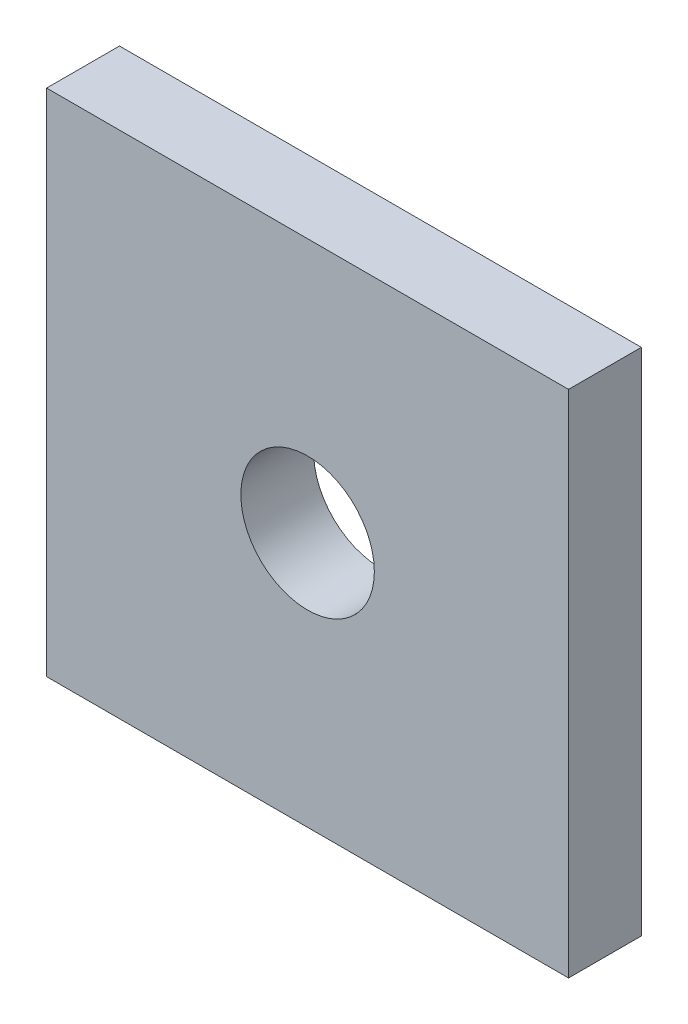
ISO-10303-21;
HEADER;
FILE_DESCRIPTION(('STEP AP214'),'2;1');
FILE_NAME('part.step','',(''),(''),'','','');
FILE_SCHEMA(('AUTOMOTIVE_DESIGN { 1 0 10303 214 1 1 1 1 }'));
ENDSEC;
DATA;
#1=APPLICATION_CONTEXT('core data for automotive mechanical design processes');
#2=APPLICATION_PROTOCOL_DEFINITION('international standard','automotive_design',2000,#1);
#3=PRODUCT_CONTEXT('',#1,'mechanical');
#4=PRODUCT('Part','Part','',(#3));
#5=PRODUCT_RELATED_PRODUCT_CATEGORY('part','',(#4));
#6=PRODUCT_DEFINITION_FORMATION('','',#4);
#7=PRODUCT_DEFINITION_CONTEXT('part definition',#1,'design');
#8=PRODUCT_DEFINITION('design','',#6,#7);
#9=PRODUCT_DEFINITION_SHAPE('','',#8);
#10=(LENGTH_UNIT() NAMED_UNIT(*) SI_UNIT(.MILLI.,.METRE.));
#11=(NAMED_UNIT(*) PLANE_ANGLE_UNIT() SI_UNIT($,.RADIAN.));
#12=(NAMED_UNIT(*) SI_UNIT($,.STERADIAN.) SOLID_ANGLE_UNIT());
#13=UNCERTAINTY_MEASURE_WITH_UNIT(LENGTH_MEASURE(1.E-05),#10,'distance_accuracy_value','');
#14=(GEOMETRIC_REPRESENTATION_CONTEXT(3) GLOBAL_UNCERTAINTY_ASSIGNED_CONTEXT((#13)) GLOBAL_UNIT_ASSIGNED_CONTEXT((#10,
#11,#12)) REPRESENTATION_CONTEXT('',''));
#15=CARTESIAN_POINT('',(0.,0.,0.));
#16=DIRECTION('',(0.,0.,1.));
#17=DIRECTION('',(1.,0.,0.));
#18=AXIS2_PLACEMENT_3D('',#15,#16,#17);
#19=CARTESIAN_POINT('',(0.,0.,6.));
#20=DIRECTION('',(0.,0.,1.));
#21=DIRECTION('',(1.,0.,0.));
#22=AXIS2_PLACEMENT_3D('',#19,#20,#21);
#23=PLANE('',#22);
#24=DIRECTION('',(0.,1.,0.));
#25=VECTOR('',#24,1.);
#26=CARTESIAN_POINT('',(21.5,21.,6.));
#27=LINE('',#26,#25);
#28=CARTESIAN_POINT('',(21.5,-21.,6.));
#29=VERTEX_POINT('',#28);
#30=CARTESIAN_POINT('',(21.5,21.,6.));
#31=VERTEX_POINT('',#30);
#32=EDGE_CURVE('E85',#29,#31,#27,.T.);
#33=ORIENTED_EDGE('',*,*,#32,.T.);
#34=DIRECTION('',(-1.,0.,0.));
#35=VECTOR('',#34,1.);
#36=CARTESIAN_POINT('',(-21.5,21.,6.));
#37=LINE('',#36,#35);
#38=CARTESIAN_POINT('',(-21.5,21.,6.));
#39=VERTEX_POINT('',#38);
#40=EDGE_CURVE('E80',#31,#39,#37,.T.);
#41=ORIENTED_EDGE('',*,*,#40,.T.);
#42=DIRECTION('',(0.,-1.,0.));
#43=VECTOR('',#42,1.);
#44=CARTESIAN_POINT('',(-21.5,21.,6.));
#45=LINE('',#44,#43);
#46=CARTESIAN_POINT('',(-21.5,-21.,6.));
#47=VERTEX_POINT('',#46);
#48=EDGE_CURVE('E83',#39,#47,#45,.T.);
#49=ORIENTED_EDGE('',*,*,#48,.T.);
#50=DIRECTION('',(1.,0.,0.));
#51=VECTOR('',#50,1.);
#52=CARTESIAN_POINT('',(-21.5,-21.,6.));
#53=LINE('',#52,#51);
#54=EDGE_CURVE('E50',#47,#29,#53,.T.);
#55=ORIENTED_EDGE('',*,*,#54,.T.);
#56=EDGE_LOOP('',(#33,#41,#49,#55));
#57=FACE_BOUND('',#56,.T.);
#58=CARTESIAN_POINT('',(0.,0.,6.));
#59=DIRECTION('',(0.,0.,1.));
#60=DIRECTION('',(1.,0.,0.));
#61=AXIS2_PLACEMENT_3D('',#58,#59,#60);
#62=CIRCLE('',#61,5.5);
#63=CARTESIAN_POINT('',(5.49999999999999,0.,6.));
#64=VERTEX_POINT('',#63);
#65=EDGE_CURVE('E100',#64,#64,#62,.T.);
#66=ORIENTED_EDGE('',*,*,#65,.F.);
#67=EDGE_LOOP('',(#66));
#68=FACE_BOUND('',#67,.T.);
#69=ADVANCED_FACE('F33',(#57,#68),#23,.T.);
#70=CARTESIAN_POINT('',(0.,0.,0.));
#71=DIRECTION('',(0.,0.,1.));
#72=DIRECTION('',(1.,0.,0.));
#73=AXIS2_PLACEMENT_3D('',#70,#71,#72);
#74=PLANE('',#73);
#75=DIRECTION('',(0.,1.,0.));
#76=VECTOR('',#75,1.);
#77=CARTESIAN_POINT('',(21.5,21.,0.));
#78=LINE('',#77,#76);
#79=CARTESIAN_POINT('',(21.5,-21.,0.));
#80=VERTEX_POINT('',#79);
#81=CARTESIAN_POINT('',(21.5,21.,0.));
#82=VERTEX_POINT('',#81);
#83=EDGE_CURVE('E97',#80,#82,#78,.T.);
#84=ORIENTED_EDGE('',*,*,#83,.F.);
#85=DIRECTION('',(1.,0.,0.));
#86=VECTOR('',#85,1.);
#87=CARTESIAN_POINT('',(-21.5,-21.,0.));
#88=LINE('',#87,#86);
#89=CARTESIAN_POINT('',(-21.5,-21.,0.));
#90=VERTEX_POINT('',#89);
#91=EDGE_CURVE('E73',#90,#80,#88,.T.);
#92=ORIENTED_EDGE('',*,*,#91,.F.);
#93=DIRECTION('',(0.,-1.,0.));
#94=VECTOR('',#93,1.);
#95=CARTESIAN_POINT('',(-21.5,21.,0.));
#96=LINE('',#95,#94);
#97=CARTESIAN_POINT('',(-21.5,21.,0.));
#98=VERTEX_POINT('',#97);
#99=EDGE_CURVE('E67',#98,#90,#96,.T.);
#100=ORIENTED_EDGE('',*,*,#99,.F.);
#101=DIRECTION('',(-1.,0.,0.));
#102=VECTOR('',#101,1.);
#103=CARTESIAN_POINT('',(-21.5,21.,0.));
#104=LINE('',#103,#102);
#105=EDGE_CURVE('E89',#82,#98,#104,.T.);
#106=ORIENTED_EDGE('',*,*,#105,.F.);
#107=EDGE_LOOP('',(#84,#92,#100,#106));
#108=FACE_BOUND('',#107,.T.);
#109=CARTESIAN_POINT('',(0.,0.,0.));
#110=DIRECTION('',(0.,0.,1.));
#111=DIRECTION('',(1.,0.,0.));
#112=AXIS2_PLACEMENT_3D('',#109,#110,#111);
#113=CIRCLE('',#112,5.5);
#114=CARTESIAN_POINT('',(5.49999999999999,0.,0.));
#115=VERTEX_POINT('',#114);
#116=EDGE_CURVE('E112',#115,#115,#113,.T.);
#117=ORIENTED_EDGE('',*,*,#116,.T.);
#118=EDGE_LOOP('',(#117));
#119=FACE_BOUND('',#118,.T.);
#120=ADVANCED_FACE('F108',(#108,#119),#74,.F.);
#121=CARTESIAN_POINT('',(21.5,21.,6.));
#122=DIRECTION('',(-1.,0.,0.));
#123=DIRECTION('',(0.,-1.,0.));
#124=AXIS2_PLACEMENT_3D('',#121,#122,#123);
#125=PLANE('',#124);
#126=ORIENTED_EDGE('',*,*,#83,.T.);
#127=DIRECTION('',(0.,0.,-1.));
#128=VECTOR('',#127,1.);
#129=CARTESIAN_POINT('',(21.5,21.,6.));
#130=LINE('',#129,#128);
#131=EDGE_CURVE('E11',#31,#82,#130,.T.);
#132=ORIENTED_EDGE('',*,*,#131,.F.);
#133=ORIENTED_EDGE('',*,*,#32,.F.);
#134=DIRECTION('',(0.,0.,-1.));
#135=VECTOR('',#134,1.);
#136=CARTESIAN_POINT('',(21.5,-21.,6.));
#137=LINE('',#136,#135);
#138=EDGE_CURVE('E93',#29,#80,#137,.T.);
#139=ORIENTED_EDGE('',*,*,#138,.T.);
#140=EDGE_LOOP('',(#126,#132,#133,#139));
#141=FACE_BOUND('',#140,.T.);
#142=ADVANCED_FACE('F35',(#141),#125,.F.);
#143=CARTESIAN_POINT('',(-21.5,21.,6.));
#144=DIRECTION('',(0.,-1.,0.));
#145=DIRECTION('',(0.,0.,-1.));
#146=AXIS2_PLACEMENT_3D('',#143,#144,#145);
#147=PLANE('',#146);
#148=ORIENTED_EDGE('',*,*,#105,.T.);
#149=DIRECTION('',(0.,0.,-1.));
#150=VECTOR('',#149,1.);
#151=CARTESIAN_POINT('',(-21.5,21.,6.));
#152=LINE('',#151,#150);
#153=EDGE_CURVE('E42',#39,#98,#152,.T.);
#154=ORIENTED_EDGE('',*,*,#153,.F.);
#155=ORIENTED_EDGE('',*,*,#40,.F.);
#156=ORIENTED_EDGE('',*,*,#131,.T.);
#157=EDGE_LOOP('',(#148,#154,#155,#156));
#158=FACE_BOUND('',#157,.T.);
#159=ADVANCED_FACE('F88',(#158),#147,.F.);
#160=CARTESIAN_POINT('',(-21.5,21.,6.));
#161=DIRECTION('',(1.,0.,0.));
#162=DIRECTION('',(0.,1.,0.));
#163=AXIS2_PLACEMENT_3D('',#160,#161,#162);
#164=PLANE('',#163);
#165=ORIENTED_EDGE('',*,*,#99,.T.);
#166=DIRECTION('',(0.,0.,-1.));
#167=VECTOR('',#166,1.);
#168=CARTESIAN_POINT('',(-21.5,-21.,6.));
#169=LINE('',#168,#167);
#170=EDGE_CURVE('E90',#47,#90,#169,.T.);
#171=ORIENTED_EDGE('',*,*,#170,.F.);
#172=ORIENTED_EDGE('',*,*,#48,.F.);
#173=ORIENTED_EDGE('',*,*,#153,.T.);
#174=EDGE_LOOP('',(#165,#171,#172,#173));
#175=FACE_BOUND('',#174,.T.);
#176=ADVANCED_FACE('F91',(#175),#164,.F.);
#177=CARTESIAN_POINT('',(-21.5,-21.,6.));
#178=DIRECTION('',(0.,1.,0.));
#179=DIRECTION('',(0.,0.,1.));
#180=AXIS2_PLACEMENT_3D('',#177,#178,#179);
#181=PLANE('',#180);
#182=ORIENTED_EDGE('',*,*,#91,.T.);
#183=ORIENTED_EDGE('',*,*,#138,.F.);
#184=ORIENTED_EDGE('',*,*,#54,.F.);
#185=ORIENTED_EDGE('',*,*,#170,.T.);
#186=EDGE_LOOP('',(#182,#183,#184,#185));
#187=FACE_BOUND('',#186,.T.);
#188=ADVANCED_FACE('F105',(#187),#181,.F.);
#189=CARTESIAN_POINT('',(0.,0.,6.));
#190=DIRECTION('',(0.,0.,-1.));
#191=DIRECTION('',(-1.,0.,0.));
#192=AXIS2_PLACEMENT_3D('',#189,#190,#191);
#193=CYLINDRICAL_SURFACE('',#192,5.5);
#194=ORIENTED_EDGE('',*,*,#65,.T.);
#195=EDGE_LOOP('',(#194));
#196=FACE_BOUND('',#195,.T.);
#197=ORIENTED_EDGE('',*,*,#116,.F.);
#198=EDGE_LOOP('',(#197));
#199=FACE_BOUND('',#198,.T.);
#200=ADVANCED_FACE('F118',(#196,#199),#193,.F.);
#201=CLOSED_SHELL('',(#69,#120,#142,#159,#176,#188,#200));
#202=MANIFOLD_SOLID_BREP('B2',#201);
#203=ADVANCED_BREP_SHAPE_REPRESENTATION('',(#18,#202),#14);
#204=SHAPE_DEFINITION_REPRESENTATION(#9,#203);
ENDSEC;
END-ISO-10303-21;
